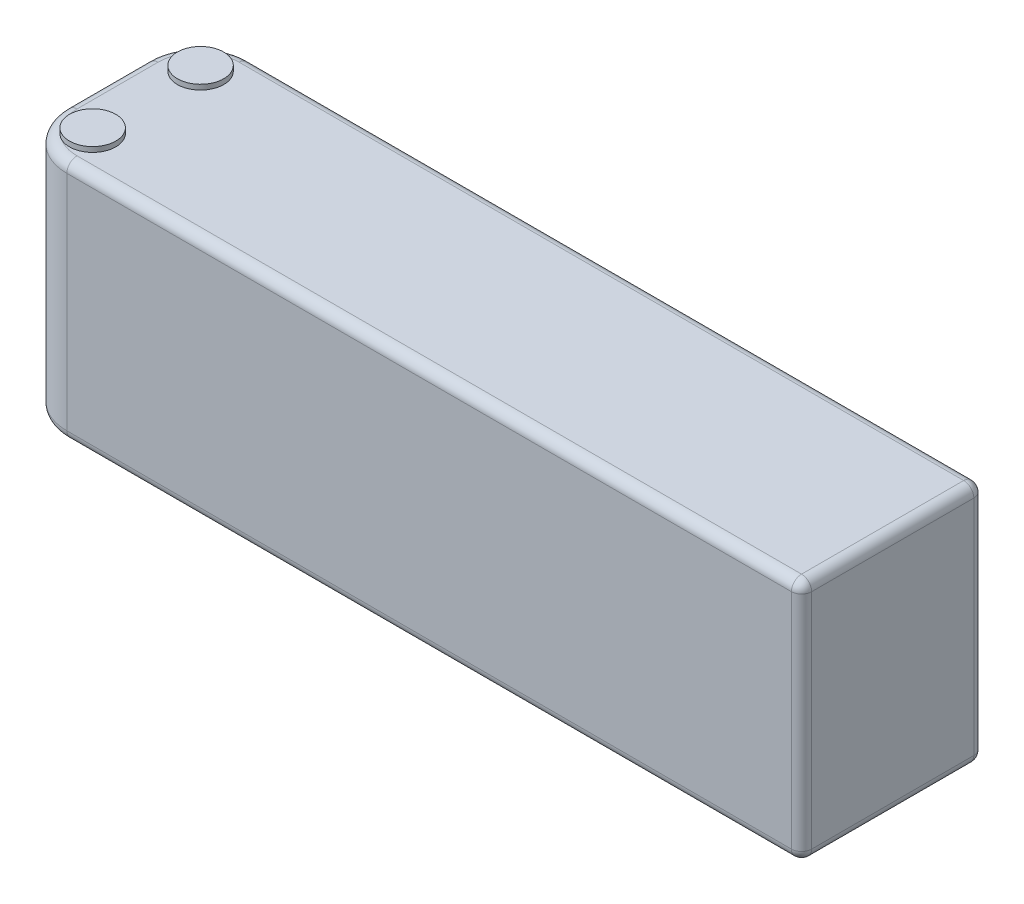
ISO-10303-21;
HEADER;
FILE_DESCRIPTION(('STEP AP214'),'2;1');
FILE_NAME('part.step','',(''),(''),'','','');
FILE_SCHEMA(('AUTOMOTIVE_DESIGN { 1 0 10303 214 1 1 1 1 }'));
ENDSEC;
DATA;
#1=APPLICATION_CONTEXT('core data for automotive mechanical design processes');
#2=APPLICATION_PROTOCOL_DEFINITION('international standard','automotive_design',2000,#1);
#3=PRODUCT_CONTEXT('',#1,'mechanical');
#4=PRODUCT('Part','Part','',(#3));
#5=PRODUCT_RELATED_PRODUCT_CATEGORY('part','',(#4));
#6=PRODUCT_DEFINITION_FORMATION('','',#4);
#7=PRODUCT_DEFINITION_CONTEXT('part definition',#1,'design');
#8=PRODUCT_DEFINITION('design','',#6,#7);
#9=PRODUCT_DEFINITION_SHAPE('','',#8);
#10=(LENGTH_UNIT() NAMED_UNIT(*) SI_UNIT(.MILLI.,.METRE.));
#11=(NAMED_UNIT(*) PLANE_ANGLE_UNIT() SI_UNIT($,.RADIAN.));
#12=(NAMED_UNIT(*) SI_UNIT($,.STERADIAN.) SOLID_ANGLE_UNIT());
#13=UNCERTAINTY_MEASURE_WITH_UNIT(LENGTH_MEASURE(1.E-05),#10,'distance_accuracy_value','');
#14=(GEOMETRIC_REPRESENTATION_CONTEXT(3) GLOBAL_UNCERTAINTY_ASSIGNED_CONTEXT((#13)) GLOBAL_UNIT_ASSIGNED_CONTEXT((#10,
#11,#12)) REPRESENTATION_CONTEXT('',''));
#15=CARTESIAN_POINT('',(0.,0.,0.));
#16=DIRECTION('',(0.,0.,1.));
#17=DIRECTION('',(1.,0.,0.));
#18=AXIS2_PLACEMENT_3D('',#15,#16,#17);
#19=CARTESIAN_POINT('',(155.,48.,0.));
#20=DIRECTION('',(-1.,0.,0.));
#21=DIRECTION('',(0.,0.,1.));
#22=AXIS2_PLACEMENT_3D('',#19,#20,#21);
#23=PLANE('',#22);
#24=DIRECTION('',(0.,0.,-1.));
#25=VECTOR('',#24,1.);
#26=CARTESIAN_POINT('',(155.,2.,0.));
#27=LINE('',#26,#25);
#28=CARTESIAN_POINT('',(155.,2.,-2.));
#29=VERTEX_POINT('',#28);
#30=CARTESIAN_POINT('',(155.,2.,-34.));
#31=VERTEX_POINT('',#30);
#32=EDGE_CURVE('E49',#29,#31,#27,.T.);
#33=ORIENTED_EDGE('',*,*,#32,.T.);
#34=DIRECTION('',(0.,-1.,0.));
#35=VECTOR('',#34,1.);
#36=CARTESIAN_POINT('',(155.,48.,-34.));
#37=LINE('',#36,#35);
#38=CARTESIAN_POINT('',(155.,46.,-34.));
#39=VERTEX_POINT('',#38);
#40=EDGE_CURVE('E11',#31,#39,#37,.F.);
#41=ORIENTED_EDGE('',*,*,#40,.T.);
#42=DIRECTION('',(0.,0.,-1.));
#43=VECTOR('',#42,1.);
#44=CARTESIAN_POINT('',(155.,46.,0.));
#45=LINE('',#44,#43);
#46=CARTESIAN_POINT('',(155.,46.,-2.));
#47=VERTEX_POINT('',#46);
#48=EDGE_CURVE('E288',#39,#47,#45,.F.);
#49=ORIENTED_EDGE('',*,*,#48,.T.);
#50=DIRECTION('',(0.,-1.,0.));
#51=VECTOR('',#50,1.);
#52=CARTESIAN_POINT('',(155.,48.,-2.));
#53=LINE('',#52,#51);
#54=EDGE_CURVE('E285',#47,#29,#53,.T.);
#55=ORIENTED_EDGE('',*,*,#54,.T.);
#56=EDGE_LOOP('',(#33,#41,#49,#55));
#57=FACE_BOUND('',#56,.T.);
#58=ADVANCED_FACE('F39',(#57),#23,.F.);
#59=CARTESIAN_POINT('',(155.,48.,-36.));
#60=DIRECTION('',(0.,0.,1.));
#61=DIRECTION('',(1.,0.,0.));
#62=AXIS2_PLACEMENT_3D('',#59,#60,#61);
#63=PLANE('',#62);
#64=DIRECTION('',(0.,-1.,0.));
#65=VECTOR('',#64,1.);
#66=CARTESIAN_POINT('',(10.0000000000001,48.,-36.));
#67=LINE('',#66,#65);
#68=CARTESIAN_POINT('',(10.0000000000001,46.,-36.));
#69=VERTEX_POINT('',#68);
#70=CARTESIAN_POINT('',(10.0000000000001,2.,-36.));
#71=VERTEX_POINT('',#70);
#72=EDGE_CURVE('E210',#69,#71,#67,.T.);
#73=ORIENTED_EDGE('',*,*,#72,.F.);
#74=DIRECTION('',(-1.,0.,0.));
#75=VECTOR('',#74,1.);
#76=CARTESIAN_POINT('',(155.,46.,-36.));
#77=LINE('',#76,#75);
#78=CARTESIAN_POINT('',(153.,46.,-36.));
#79=VERTEX_POINT('',#78);
#80=EDGE_CURVE('E274',#69,#79,#77,.F.);
#81=ORIENTED_EDGE('',*,*,#80,.T.);
#82=DIRECTION('',(0.,-1.,0.));
#83=VECTOR('',#82,1.);
#84=CARTESIAN_POINT('',(153.,48.,-36.));
#85=LINE('',#84,#83);
#86=CARTESIAN_POINT('',(153.,2.,-36.));
#87=VERTEX_POINT('',#86);
#88=EDGE_CURVE('E271',#79,#87,#85,.T.);
#89=ORIENTED_EDGE('',*,*,#88,.T.);
#90=DIRECTION('',(-1.,0.,0.));
#91=VECTOR('',#90,1.);
#92=CARTESIAN_POINT('',(155.,2.,-36.));
#93=LINE('',#92,#91);
#94=EDGE_CURVE('E268',#87,#71,#93,.T.);
#95=ORIENTED_EDGE('',*,*,#94,.T.);
#96=EDGE_LOOP('',(#73,#81,#89,#95));
#97=FACE_BOUND('',#96,.T.);
#98=ADVANCED_FACE('F431',(#97),#63,.F.);
#99=CARTESIAN_POINT('',(10.,48.,-26.));
#100=DIRECTION('',(0.,-1.,0.));
#101=DIRECTION('',(0.,0.,-1.));
#102=AXIS2_PLACEMENT_3D('',#99,#100,#101);
#103=CYLINDRICAL_SURFACE('',#102,10.);
#104=DIRECTION('',(0.,-1.,0.));
#105=VECTOR('',#104,1.);
#106=CARTESIAN_POINT('',(0.,48.,-25.9999999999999));
#107=LINE('',#106,#105);
#108=CARTESIAN_POINT('',(0.,46.,-25.9999999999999));
#109=VERTEX_POINT('',#108);
#110=CARTESIAN_POINT('',(0.,2.,-25.9999999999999));
#111=VERTEX_POINT('',#110);
#112=EDGE_CURVE('E206',#109,#111,#107,.T.);
#113=ORIENTED_EDGE('',*,*,#112,.F.);
#114=CARTESIAN_POINT('',(10.,46.,-26.));
#115=DIRECTION('',(0.,1.,0.));
#116=DIRECTION('',(0.,0.,1.));
#117=AXIS2_PLACEMENT_3D('',#114,#115,#116);
#118=CIRCLE('',#117,10.);
#119=EDGE_CURVE('E233',#109,#69,#118,.F.);
#120=ORIENTED_EDGE('',*,*,#119,.T.);
#121=ORIENTED_EDGE('',*,*,#72,.T.);
#122=CARTESIAN_POINT('',(10.,2.,-26.));
#123=DIRECTION('',(0.,1.,0.));
#124=DIRECTION('',(0.,0.,1.));
#125=AXIS2_PLACEMENT_3D('',#122,#123,#124);
#126=CIRCLE('',#125,10.);
#127=EDGE_CURVE('E230',#71,#111,#126,.T.);
#128=ORIENTED_EDGE('',*,*,#127,.T.);
#129=EDGE_LOOP('',(#113,#120,#121,#128));
#130=FACE_BOUND('',#129,.T.);
#131=ADVANCED_FACE('F419',(#130),#103,.T.);
#132=CARTESIAN_POINT('',(0.,48.,-25.9999999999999));
#133=DIRECTION('',(1.,0.,0.));
#134=DIRECTION('',(0.,0.,-1.));
#135=AXIS2_PLACEMENT_3D('',#132,#133,#134);
#136=PLANE('',#135);
#137=DIRECTION('',(0.,-1.,0.));
#138=VECTOR('',#137,1.);
#139=CARTESIAN_POINT('',(0.,48.,-10.0000000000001));
#140=LINE('',#139,#138);
#141=CARTESIAN_POINT('',(0.,46.,-10.0000000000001));
#142=VERTEX_POINT('',#141);
#143=CARTESIAN_POINT('',(0.,2.,-10.0000000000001));
#144=VERTEX_POINT('',#143);
#145=EDGE_CURVE('E202',#142,#144,#140,.T.);
#146=ORIENTED_EDGE('',*,*,#145,.F.);
#147=DIRECTION('',(0.,0.,1.));
#148=VECTOR('',#147,1.);
#149=CARTESIAN_POINT('',(0.,46.,-25.9999999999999));
#150=LINE('',#149,#148);
#151=EDGE_CURVE('E240',#142,#109,#150,.F.);
#152=ORIENTED_EDGE('',*,*,#151,.T.);
#153=ORIENTED_EDGE('',*,*,#112,.T.);
#154=DIRECTION('',(0.,0.,1.));
#155=VECTOR('',#154,1.);
#156=CARTESIAN_POINT('',(0.,2.,-25.9999999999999));
#157=LINE('',#156,#155);
#158=EDGE_CURVE('E237',#111,#144,#157,.T.);
#159=ORIENTED_EDGE('',*,*,#158,.T.);
#160=EDGE_LOOP('',(#146,#152,#153,#159));
#161=FACE_BOUND('',#160,.T.);
#162=ADVANCED_FACE('F416',(#161),#136,.F.);
#163=CARTESIAN_POINT('',(10.,48.,-10.));
#164=DIRECTION('',(0.,-1.,0.));
#165=DIRECTION('',(0.,0.,-1.));
#166=AXIS2_PLACEMENT_3D('',#163,#164,#165);
#167=CYLINDRICAL_SURFACE('',#166,10.);
#168=DIRECTION('',(0.,-1.,0.));
#169=VECTOR('',#168,1.);
#170=CARTESIAN_POINT('',(10.0000000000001,48.,0.));
#171=LINE('',#170,#169);
#172=CARTESIAN_POINT('',(10.0000000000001,46.,0.));
#173=VERTEX_POINT('',#172);
#174=CARTESIAN_POINT('',(10.0000000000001,2.,0.));
#175=VERTEX_POINT('',#174);
#176=EDGE_CURVE('E198',#173,#175,#171,.T.);
#177=ORIENTED_EDGE('',*,*,#176,.F.);
#178=CARTESIAN_POINT('',(10.,46.,-10.));
#179=DIRECTION('',(0.,1.,0.));
#180=DIRECTION('',(0.,0.,1.));
#181=AXIS2_PLACEMENT_3D('',#178,#179,#180);
#182=CIRCLE('',#181,10.);
#183=EDGE_CURVE('E246',#173,#142,#182,.F.);
#184=ORIENTED_EDGE('',*,*,#183,.T.);
#185=ORIENTED_EDGE('',*,*,#145,.T.);
#186=CARTESIAN_POINT('',(10.,2.,-10.));
#187=DIRECTION('',(0.,1.,0.));
#188=DIRECTION('',(0.,0.,1.));
#189=AXIS2_PLACEMENT_3D('',#186,#187,#188);
#190=CIRCLE('',#189,10.);
#191=EDGE_CURVE('E243',#144,#175,#190,.T.);
#192=ORIENTED_EDGE('',*,*,#191,.T.);
#193=EDGE_LOOP('',(#177,#184,#185,#192));
#194=FACE_BOUND('',#193,.T.);
#195=ADVANCED_FACE('F404',(#194),#167,.T.);
#196=CARTESIAN_POINT('',(10.0000000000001,48.,0.));
#197=DIRECTION('',(0.,0.,-1.));
#198=DIRECTION('',(-1.,0.,0.));
#199=AXIS2_PLACEMENT_3D('',#196,#197,#198);
#200=PLANE('',#199);
#201=ORIENTED_EDGE('',*,*,#176,.T.);
#202=DIRECTION('',(1.,0.,0.));
#203=VECTOR('',#202,1.);
#204=CARTESIAN_POINT('',(10.0000000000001,2.,0.));
#205=LINE('',#204,#203);
#206=CARTESIAN_POINT('',(153.,2.,0.));
#207=VERTEX_POINT('',#206);
#208=EDGE_CURVE('E282',#175,#207,#205,.T.);
#209=ORIENTED_EDGE('',*,*,#208,.T.);
#210=DIRECTION('',(0.,-1.,0.));
#211=VECTOR('',#210,1.);
#212=CARTESIAN_POINT('',(153.,48.,0.));
#213=LINE('',#212,#211);
#214=CARTESIAN_POINT('',(153.,46.,0.));
#215=VERTEX_POINT('',#214);
#216=EDGE_CURVE('E277',#207,#215,#213,.F.);
#217=ORIENTED_EDGE('',*,*,#216,.T.);
#218=DIRECTION('',(1.,0.,0.));
#219=VECTOR('',#218,1.);
#220=CARTESIAN_POINT('',(10.0000000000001,46.,0.));
#221=LINE('',#220,#219);
#222=EDGE_CURVE('E280',#215,#173,#221,.F.);
#223=ORIENTED_EDGE('',*,*,#222,.T.);
#224=EDGE_LOOP('',(#201,#209,#217,#223));
#225=FACE_BOUND('',#224,.T.);
#226=ADVANCED_FACE('F400',(#225),#200,.F.);
#227=CARTESIAN_POINT('',(10.,48.,-26.));
#228=DIRECTION('',(0.,1.,0.));
#229=DIRECTION('',(0.,0.,1.));
#230=AXIS2_PLACEMENT_3D('',#227,#228,#229);
#231=PLANE('',#230);
#232=CARTESIAN_POINT('',(10.,48.,-10.));
#233=DIRECTION('',(0.,1.,0.));
#234=DIRECTION('',(0.,0.,1.));
#235=AXIS2_PLACEMENT_3D('',#232,#233,#234);
#236=CIRCLE('',#235,8.);
#237=CARTESIAN_POINT('',(2.,48.,-10.0000000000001));
#238=VERTEX_POINT('',#237);
#239=CARTESIAN_POINT('',(4.02544666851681,48.,-4.67978266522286));
#240=VERTEX_POINT('',#239);
#241=EDGE_CURVE('E166',#238,#240,#236,.T.);
#242=ORIENTED_EDGE('',*,*,#241,.T.);
#243=CARTESIAN_POINT('',(7.73813967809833,48.,-7.34911066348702));
#244=DIRECTION('',(0.,1.,0.));
#245=DIRECTION('',(0.,0.,-1.));
#246=AXIS2_PLACEMENT_3D('',#243,#244,#245);
#247=CIRCLE('',#246,4.57267988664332);
#248=CARTESIAN_POINT('',(5.68641463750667,48.,-3.26256864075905));
#249=VERTEX_POINT('',#248);
#250=EDGE_CURVE('E168',#249,#240,#247,.T.);
#251=ORIENTED_EDGE('',*,*,#250,.F.);
#252=CARTESIAN_POINT('',(10.0000000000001,48.,-2.));
#253=VERTEX_POINT('',#252);
#254=EDGE_CURVE('E155',#249,#253,#236,.T.);
#255=ORIENTED_EDGE('',*,*,#254,.T.);
#256=DIRECTION('',(1.,0.,0.));
#257=VECTOR('',#256,1.);
#258=CARTESIAN_POINT('',(155.,48.,-2.));
#259=LINE('',#258,#257);
#260=CARTESIAN_POINT('',(153.,48.,-2.));
#261=VERTEX_POINT('',#260);
#262=EDGE_CURVE('E217',#253,#261,#259,.T.);
#263=ORIENTED_EDGE('',*,*,#262,.T.);
#264=DIRECTION('',(0.,0.,-1.));
#265=VECTOR('',#264,1.);
#266=CARTESIAN_POINT('',(153.,48.,-36.));
#267=LINE('',#266,#265);
#268=CARTESIAN_POINT('',(153.,48.,-34.));
#269=VERTEX_POINT('',#268);
#270=EDGE_CURVE('E214',#261,#269,#267,.T.);
#271=ORIENTED_EDGE('',*,*,#270,.T.);
#272=DIRECTION('',(-1.,0.,0.));
#273=VECTOR('',#272,1.);
#274=CARTESIAN_POINT('',(10.0000000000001,48.,-34.));
#275=LINE('',#274,#273);
#276=CARTESIAN_POINT('',(10.0000000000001,48.,-34.));
#277=VERTEX_POINT('',#276);
#278=EDGE_CURVE('E164',#269,#277,#275,.T.);
#279=ORIENTED_EDGE('',*,*,#278,.T.);
#280=CARTESIAN_POINT('',(10.,48.,-26.));
#281=DIRECTION('',(0.,1.,0.));
#282=DIRECTION('',(0.,0.,1.));
#283=AXIS2_PLACEMENT_3D('',#280,#281,#282);
#284=CIRCLE('',#283,8.);
#285=CARTESIAN_POINT('',(5.68641463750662,48.,-32.7374313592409));
#286=VERTEX_POINT('',#285);
#287=EDGE_CURVE('E227',#277,#286,#284,.T.);
#288=ORIENTED_EDGE('',*,*,#287,.T.);
#289=CARTESIAN_POINT('',(7.73813967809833,48.,-28.650889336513));
#290=DIRECTION('',(0.,1.,0.));
#291=DIRECTION('',(0.,0.,1.));
#292=AXIS2_PLACEMENT_3D('',#289,#290,#291);
#293=CIRCLE('',#292,4.57267988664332);
#294=CARTESIAN_POINT('',(4.02544666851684,48.,-31.3202173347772));
#295=VERTEX_POINT('',#294);
#296=EDGE_CURVE('E186',#295,#286,#293,.T.);
#297=ORIENTED_EDGE('',*,*,#296,.F.);
#298=CARTESIAN_POINT('',(2.,48.,-25.9999999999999));
#299=VERTEX_POINT('',#298);
#300=EDGE_CURVE('E226',#295,#299,#284,.T.);
#301=ORIENTED_EDGE('',*,*,#300,.T.);
#302=DIRECTION('',(0.,0.,1.));
#303=VECTOR('',#302,1.);
#304=CARTESIAN_POINT('',(2.,48.,-10.0000000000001));
#305=LINE('',#304,#303);
#306=EDGE_CURVE('E223',#299,#238,#305,.T.);
#307=ORIENTED_EDGE('',*,*,#306,.T.);
#308=EDGE_LOOP('',(#242,#251,#255,#263,#271,#279,#288,#297,#301,#307));
#309=FACE_BOUND('',#308,.T.);
#310=ADVANCED_FACE('F169',(#309),#231,.T.);
#311=CARTESIAN_POINT('',(10.,0.,-26.));
#312=DIRECTION('',(0.,1.,0.));
#313=DIRECTION('',(0.,0.,1.));
#314=AXIS2_PLACEMENT_3D('',#311,#312,#313);
#315=PLANE('',#314);
#316=DIRECTION('',(1.,0.,0.));
#317=VECTOR('',#316,1.);
#318=CARTESIAN_POINT('',(10.,0.,-2.));
#319=LINE('',#318,#317);
#320=CARTESIAN_POINT('',(153.,0.,-2.));
#321=VERTEX_POINT('',#320);
#322=CARTESIAN_POINT('',(10.0000000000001,0.,-2.));
#323=VERTEX_POINT('',#322);
#324=EDGE_CURVE('E255',#321,#323,#319,.F.);
#325=ORIENTED_EDGE('',*,*,#324,.T.);
#326=CARTESIAN_POINT('',(10.,0.,-10.));
#327=DIRECTION('',(0.,1.,0.));
#328=DIRECTION('',(0.,0.,1.));
#329=AXIS2_PLACEMENT_3D('',#326,#327,#328);
#330=CIRCLE('',#329,8.);
#331=CARTESIAN_POINT('',(2.,0.,-10.0000000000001));
#332=VERTEX_POINT('',#331);
#333=EDGE_CURVE('E264',#323,#332,#330,.F.);
#334=ORIENTED_EDGE('',*,*,#333,.T.);
#335=DIRECTION('',(0.,0.,1.));
#336=VECTOR('',#335,1.);
#337=CARTESIAN_POINT('',(2.,0.,-26.));
#338=LINE('',#337,#336);
#339=CARTESIAN_POINT('',(2.,0.,-25.9999999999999));
#340=VERTEX_POINT('',#339);
#341=EDGE_CURVE('E261',#332,#340,#338,.F.);
#342=ORIENTED_EDGE('',*,*,#341,.T.);
#343=CARTESIAN_POINT('',(10.,0.,-26.));
#344=DIRECTION('',(0.,1.,0.));
#345=DIRECTION('',(0.,0.,1.));
#346=AXIS2_PLACEMENT_3D('',#343,#344,#345);
#347=CIRCLE('',#346,8.);
#348=CARTESIAN_POINT('',(10.0000000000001,0.,-34.));
#349=VERTEX_POINT('',#348);
#350=EDGE_CURVE('E258',#340,#349,#347,.F.);
#351=ORIENTED_EDGE('',*,*,#350,.T.);
#352=DIRECTION('',(-1.,0.,0.));
#353=VECTOR('',#352,1.);
#354=CARTESIAN_POINT('',(10.,0.,-34.));
#355=LINE('',#354,#353);
#356=CARTESIAN_POINT('',(153.,0.,-34.));
#357=VERTEX_POINT('',#356);
#358=EDGE_CURVE('E249',#349,#357,#355,.F.);
#359=ORIENTED_EDGE('',*,*,#358,.T.);
#360=DIRECTION('',(0.,0.,-1.));
#361=VECTOR('',#360,1.);
#362=CARTESIAN_POINT('',(153.,0.,-26.));
#363=LINE('',#362,#361);
#364=EDGE_CURVE('E252',#357,#321,#363,.F.);
#365=ORIENTED_EDGE('',*,*,#364,.T.);
#366=EDGE_LOOP('',(#325,#334,#342,#351,#359,#365));
#367=FACE_BOUND('',#366,.T.);
#368=ADVANCED_FACE('F376',(#367),#315,.F.);
#369=CARTESIAN_POINT('',(10.,2.,-10.));
#370=DIRECTION('',(0.,1.,0.));
#371=DIRECTION('',(0.,0.,1.));
#372=AXIS2_PLACEMENT_3D('',#369,#370,#371);
#373=TOROIDAL_SURFACE('',#372,8.,2.);
#374=CARTESIAN_POINT('',(10.0000000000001,2.,-2.));
#375=DIRECTION('',(1.,0.,0.));
#376=DIRECTION('',(0.,0.,-1.));
#377=AXIS2_PLACEMENT_3D('',#374,#375,#376);
#378=CIRCLE('',#377,2.);
#379=EDGE_CURVE('E358',#175,#323,#378,.T.);
#380=ORIENTED_EDGE('',*,*,#379,.F.);
#381=ORIENTED_EDGE('',*,*,#191,.F.);
#382=CARTESIAN_POINT('',(2.,2.,-10.0000000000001));
#383=DIRECTION('',(0.,0.,-1.));
#384=DIRECTION('',(-1.,0.,0.));
#385=AXIS2_PLACEMENT_3D('',#382,#383,#384);
#386=CIRCLE('',#385,2.);
#387=EDGE_CURVE('E43',#332,#144,#386,.T.);
#388=ORIENTED_EDGE('',*,*,#387,.F.);
#389=ORIENTED_EDGE('',*,*,#333,.F.);
#390=EDGE_LOOP('',(#380,#381,#388,#389));
#391=FACE_BOUND('',#390,.T.);
#392=ADVANCED_FACE('F41',(#391),#373,.T.);
#393=CARTESIAN_POINT('',(2.,2.,-25.9999999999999));
#394=DIRECTION('',(0.,0.,1.));
#395=DIRECTION('',(1.,0.,0.));
#396=AXIS2_PLACEMENT_3D('',#393,#394,#395);
#397=CYLINDRICAL_SURFACE('',#396,2.);
#398=ORIENTED_EDGE('',*,*,#387,.T.);
#399=ORIENTED_EDGE('',*,*,#158,.F.);
#400=CARTESIAN_POINT('',(2.,2.,-25.9999999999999));
#401=DIRECTION('',(0.,0.,-1.));
#402=DIRECTION('',(-1.,0.,0.));
#403=AXIS2_PLACEMENT_3D('',#400,#401,#402);
#404=CIRCLE('',#403,2.);
#405=EDGE_CURVE('E355',#340,#111,#404,.T.);
#406=ORIENTED_EDGE('',*,*,#405,.F.);
#407=ORIENTED_EDGE('',*,*,#341,.F.);
#408=EDGE_LOOP('',(#398,#399,#406,#407));
#409=FACE_BOUND('',#408,.T.);
#410=ADVANCED_FACE('F370',(#409),#397,.T.);
#411=CARTESIAN_POINT('',(10.0000000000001,2.,-2.));
#412=DIRECTION('',(1.,0.,0.));
#413=DIRECTION('',(0.,0.,-1.));
#414=AXIS2_PLACEMENT_3D('',#411,#412,#413);
#415=CYLINDRICAL_SURFACE('',#414,2.);
#416=ORIENTED_EDGE('',*,*,#379,.T.);
#417=ORIENTED_EDGE('',*,*,#324,.F.);
#418=CARTESIAN_POINT('',(153.,2.,-2.));
#419=DIRECTION('',(1.,0.,0.));
#420=DIRECTION('',(0.,0.,-1.));
#421=AXIS2_PLACEMENT_3D('',#418,#419,#420);
#422=CIRCLE('',#421,2.);
#423=EDGE_CURVE('E351',#207,#321,#422,.T.);
#424=ORIENTED_EDGE('',*,*,#423,.F.);
#425=ORIENTED_EDGE('',*,*,#208,.F.);
#426=EDGE_LOOP('',(#416,#417,#424,#425));
#427=FACE_BOUND('',#426,.T.);
#428=ADVANCED_FACE('F379',(#427),#415,.T.);
#429=CARTESIAN_POINT('',(10.,2.,-26.));
#430=DIRECTION('',(0.,1.,0.));
#431=DIRECTION('',(0.,0.,1.));
#432=AXIS2_PLACEMENT_3D('',#429,#430,#431);
#433=TOROIDAL_SURFACE('',#432,8.,2.);
#434=ORIENTED_EDGE('',*,*,#405,.T.);
#435=ORIENTED_EDGE('',*,*,#127,.F.);
#436=CARTESIAN_POINT('',(10.0000000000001,2.,-34.));
#437=DIRECTION('',(1.,0.,0.));
#438=DIRECTION('',(0.,0.,-1.));
#439=AXIS2_PLACEMENT_3D('',#436,#437,#438);
#440=CIRCLE('',#439,2.);
#441=EDGE_CURVE('E347',#349,#71,#440,.T.);
#442=ORIENTED_EDGE('',*,*,#441,.F.);
#443=ORIENTED_EDGE('',*,*,#350,.F.);
#444=EDGE_LOOP('',(#434,#435,#442,#443));
#445=FACE_BOUND('',#444,.T.);
#446=ADVANCED_FACE('F681',(#445),#433,.T.);
#447=CARTESIAN_POINT('',(153.,2.,-2.));
#448=DIRECTION('',(0.,-1.,0.));
#449=DIRECTION('',(0.,0.,-1.));
#450=AXIS2_PLACEMENT_3D('',#447,#448,#449);
#451=SPHERICAL_SURFACE('',#450,2.);
#452=CARTESIAN_POINT('',(153.,2.,-2.));
#453=DIRECTION('',(0.,-1.,0.));
#454=DIRECTION('',(0.,0.,-1.));
#455=AXIS2_PLACEMENT_3D('',#452,#453,#454);
#456=CIRCLE('',#455,2.);
#457=EDGE_CURVE('E339',#207,#29,#456,.F.);
#458=ORIENTED_EDGE('',*,*,#457,.F.);
#459=ORIENTED_EDGE('',*,*,#423,.T.);
#460=CARTESIAN_POINT('',(153.,2.,-2.));
#461=DIRECTION('',(0.,0.,1.));
#462=DIRECTION('',(1.,0.,0.));
#463=AXIS2_PLACEMENT_3D('',#460,#461,#462);
#464=CIRCLE('',#463,2.);
#465=EDGE_CURVE('E343',#29,#321,#464,.F.);
#466=ORIENTED_EDGE('',*,*,#465,.F.);
#467=EDGE_LOOP('',(#458,#459,#466));
#468=FACE_BOUND('',#467,.T.);
#469=ADVANCED_FACE('F383',(#468),#451,.T.);
#470=CARTESIAN_POINT('',(155.,2.,-34.));
#471=DIRECTION('',(-1.,0.,0.));
#472=DIRECTION('',(0.,0.,1.));
#473=AXIS2_PLACEMENT_3D('',#470,#471,#472);
#474=CYLINDRICAL_SURFACE('',#473,2.);
#475=ORIENTED_EDGE('',*,*,#441,.T.);
#476=ORIENTED_EDGE('',*,*,#94,.F.);
#477=CARTESIAN_POINT('',(153.,2.,-34.));
#478=DIRECTION('',(1.,0.,0.));
#479=DIRECTION('',(0.,0.,-1.));
#480=AXIS2_PLACEMENT_3D('',#477,#478,#479);
#481=CIRCLE('',#480,2.);
#482=EDGE_CURVE('E335',#357,#87,#481,.T.);
#483=ORIENTED_EDGE('',*,*,#482,.F.);
#484=ORIENTED_EDGE('',*,*,#358,.F.);
#485=EDGE_LOOP('',(#475,#476,#483,#484));
#486=FACE_BOUND('',#485,.T.);
#487=ADVANCED_FACE('F660',(#486),#474,.T.);
#488=CARTESIAN_POINT('',(153.,2.,0.));
#489=DIRECTION('',(0.,0.,-1.));
#490=DIRECTION('',(-1.,0.,0.));
#491=AXIS2_PLACEMENT_3D('',#488,#489,#490);
#492=CYLINDRICAL_SURFACE('',#491,2.);
#493=ORIENTED_EDGE('',*,*,#465,.T.);
#494=ORIENTED_EDGE('',*,*,#364,.F.);
#495=CARTESIAN_POINT('',(153.,2.,-34.));
#496=DIRECTION('',(0.,0.,-1.));
#497=DIRECTION('',(-1.,0.,0.));
#498=AXIS2_PLACEMENT_3D('',#495,#496,#497);
#499=CIRCLE('',#498,2.);
#500=EDGE_CURVE('E331',#31,#357,#499,.T.);
#501=ORIENTED_EDGE('',*,*,#500,.F.);
#502=ORIENTED_EDGE('',*,*,#32,.F.);
#503=EDGE_LOOP('',(#493,#494,#501,#502));
#504=FACE_BOUND('',#503,.T.);
#505=ADVANCED_FACE('F387',(#504),#492,.T.);
#506=CARTESIAN_POINT('',(153.,48.,-2.));
#507=DIRECTION('',(0.,-1.,0.));
#508=DIRECTION('',(0.,0.,-1.));
#509=AXIS2_PLACEMENT_3D('',#506,#507,#508);
#510=CYLINDRICAL_SURFACE('',#509,2.);
#511=ORIENTED_EDGE('',*,*,#457,.T.);
#512=ORIENTED_EDGE('',*,*,#54,.F.);
#513=CARTESIAN_POINT('',(153.,46.,-2.));
#514=DIRECTION('',(0.,1.,0.));
#515=DIRECTION('',(0.,0.,1.));
#516=AXIS2_PLACEMENT_3D('',#513,#514,#515);
#517=CIRCLE('',#516,2.);
#518=EDGE_CURVE('E327',#215,#47,#517,.T.);
#519=ORIENTED_EDGE('',*,*,#518,.F.);
#520=ORIENTED_EDGE('',*,*,#216,.F.);
#521=EDGE_LOOP('',(#511,#512,#519,#520));
#522=FACE_BOUND('',#521,.T.);
#523=ADVANCED_FACE('F397',(#522),#510,.T.);
#524=CARTESIAN_POINT('',(153.,2.,-34.));
#525=DIRECTION('',(0.,-1.,0.));
#526=DIRECTION('',(0.,0.,-1.));
#527=AXIS2_PLACEMENT_3D('',#524,#525,#526);
#528=SPHERICAL_SURFACE('',#527,2.);
#529=ORIENTED_EDGE('',*,*,#500,.T.);
#530=ORIENTED_EDGE('',*,*,#482,.T.);
#531=CARTESIAN_POINT('',(153.,2.,-34.));
#532=DIRECTION('',(0.,-1.,0.));
#533=DIRECTION('',(0.,0.,-1.));
#534=AXIS2_PLACEMENT_3D('',#531,#532,#533);
#535=CIRCLE('',#534,2.);
#536=EDGE_CURVE('E323',#31,#87,#535,.F.);
#537=ORIENTED_EDGE('',*,*,#536,.F.);
#538=EDGE_LOOP('',(#529,#530,#537));
#539=FACE_BOUND('',#538,.T.);
#540=ADVANCED_FACE('F446',(#539),#528,.T.);
#541=CARTESIAN_POINT('',(153.,46.,-2.));
#542=DIRECTION('',(1.,0.,0.));
#543=DIRECTION('',(0.,0.,-1.));
#544=AXIS2_PLACEMENT_3D('',#541,#542,#543);
#545=SPHERICAL_SURFACE('',#544,2.);
#546=CARTESIAN_POINT('',(153.,46.,-2.));
#547=DIRECTION('',(1.,0.,0.));
#548=DIRECTION('',(0.,0.,-1.));
#549=AXIS2_PLACEMENT_3D('',#546,#547,#548);
#550=CIRCLE('',#549,2.);
#551=EDGE_CURVE('E315',#215,#261,#550,.F.);
#552=ORIENTED_EDGE('',*,*,#551,.F.);
#553=ORIENTED_EDGE('',*,*,#518,.T.);
#554=CARTESIAN_POINT('',(153.,46.,-2.));
#555=DIRECTION('',(0.,0.,1.));
#556=DIRECTION('',(0.,-1.,0.));
#557=AXIS2_PLACEMENT_3D('',#554,#555,#556);
#558=CIRCLE('',#557,2.);
#559=EDGE_CURVE('E319',#261,#47,#558,.F.);
#560=ORIENTED_EDGE('',*,*,#559,.F.);
#561=EDGE_LOOP('',(#552,#553,#560));
#562=FACE_BOUND('',#561,.T.);
#563=ADVANCED_FACE('F444',(#562),#545,.T.);
#564=CARTESIAN_POINT('',(153.,48.,-34.));
#565=DIRECTION('',(0.,-1.,0.));
#566=DIRECTION('',(0.,0.,-1.));
#567=AXIS2_PLACEMENT_3D('',#564,#565,#566);
#568=CYLINDRICAL_SURFACE('',#567,2.);
#569=ORIENTED_EDGE('',*,*,#536,.T.);
#570=ORIENTED_EDGE('',*,*,#88,.F.);
#571=CARTESIAN_POINT('',(153.,46.,-34.));
#572=DIRECTION('',(0.,1.,0.));
#573=DIRECTION('',(0.,0.,1.));
#574=AXIS2_PLACEMENT_3D('',#571,#572,#573);
#575=CIRCLE('',#574,2.);
#576=EDGE_CURVE('E311',#39,#79,#575,.T.);
#577=ORIENTED_EDGE('',*,*,#576,.F.);
#578=ORIENTED_EDGE('',*,*,#40,.F.);
#579=EDGE_LOOP('',(#569,#570,#577,#578));
#580=FACE_BOUND('',#579,.T.);
#581=ADVANCED_FACE('F435',(#580),#568,.T.);
#582=CARTESIAN_POINT('',(153.,46.,-26.));
#583=DIRECTION('',(0.,0.,1.));
#584=DIRECTION('',(1.,0.,0.));
#585=AXIS2_PLACEMENT_3D('',#582,#583,#584);
#586=CYLINDRICAL_SURFACE('',#585,2.);
#587=ORIENTED_EDGE('',*,*,#559,.T.);
#588=ORIENTED_EDGE('',*,*,#48,.F.);
#589=CARTESIAN_POINT('',(153.,46.,-34.));
#590=DIRECTION('',(0.,0.,-1.));
#591=DIRECTION('',(-1.,0.,0.));
#592=AXIS2_PLACEMENT_3D('',#589,#590,#591);
#593=CIRCLE('',#592,2.);
#594=EDGE_CURVE('E308',#269,#39,#593,.T.);
#595=ORIENTED_EDGE('',*,*,#594,.F.);
#596=ORIENTED_EDGE('',*,*,#270,.F.);
#597=EDGE_LOOP('',(#587,#588,#595,#596));
#598=FACE_BOUND('',#597,.T.);
#599=ADVANCED_FACE('F441',(#598),#586,.T.);
#600=CARTESIAN_POINT('',(10.,46.,-2.));
#601=DIRECTION('',(-1.,0.,0.));
#602=DIRECTION('',(0.,0.,1.));
#603=AXIS2_PLACEMENT_3D('',#600,#601,#602);
#604=CYLINDRICAL_SURFACE('',#603,2.);
#605=ORIENTED_EDGE('',*,*,#551,.T.);
#606=ORIENTED_EDGE('',*,*,#262,.F.);
#607=CARTESIAN_POINT('',(10.0000000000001,46.,-2.));
#608=DIRECTION('',(-1.,0.,0.));
#609=DIRECTION('',(0.,-1.,0.));
#610=AXIS2_PLACEMENT_3D('',#607,#608,#609);
#611=CIRCLE('',#610,2.);
#612=EDGE_CURVE('E160',#173,#253,#611,.T.);
#613=ORIENTED_EDGE('',*,*,#612,.F.);
#614=ORIENTED_EDGE('',*,*,#222,.F.);
#615=EDGE_LOOP('',(#605,#606,#613,#614));
#616=FACE_BOUND('',#615,.T.);
#617=ADVANCED_FACE('F407',(#616),#604,.T.);
#618=CARTESIAN_POINT('',(153.,46.,-34.));
#619=DIRECTION('',(1.,0.,0.));
#620=DIRECTION('',(0.,0.,-1.));
#621=AXIS2_PLACEMENT_3D('',#618,#619,#620);
#622=SPHERICAL_SURFACE('',#621,2.);
#623=ORIENTED_EDGE('',*,*,#594,.T.);
#624=ORIENTED_EDGE('',*,*,#576,.T.);
#625=CARTESIAN_POINT('',(153.,46.,-34.));
#626=DIRECTION('',(1.,0.,0.));
#627=DIRECTION('',(0.,0.,-1.));
#628=AXIS2_PLACEMENT_3D('',#625,#626,#627);
#629=CIRCLE('',#628,2.);
#630=EDGE_CURVE('E303',#269,#79,#629,.F.);
#631=ORIENTED_EDGE('',*,*,#630,.F.);
#632=EDGE_LOOP('',(#623,#624,#631));
#633=FACE_BOUND('',#632,.T.);
#634=ADVANCED_FACE('F437',(#633),#622,.T.);
#635=CARTESIAN_POINT('',(10.,46.,-10.));
#636=DIRECTION('',(0.,1.,0.));
#637=DIRECTION('',(0.,0.,1.));
#638=AXIS2_PLACEMENT_3D('',#635,#636,#637);
#639=TOROIDAL_SURFACE('',#638,8.,2.);
#640=ORIENTED_EDGE('',*,*,#612,.T.);
#641=ORIENTED_EDGE('',*,*,#254,.F.);
#642=EDGE_CURVE('E57',#240,#249,#236,.T.);
#643=ORIENTED_EDGE('',*,*,#642,.F.);
#644=ORIENTED_EDGE('',*,*,#241,.F.);
#645=CARTESIAN_POINT('',(2.,46.,-10.0000000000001));
#646=DIRECTION('',(0.,0.,-1.));
#647=DIRECTION('',(-1.,0.,0.));
#648=AXIS2_PLACEMENT_3D('',#645,#646,#647);
#649=CIRCLE('',#648,2.);
#650=EDGE_CURVE('E299',#142,#238,#649,.T.);
#651=ORIENTED_EDGE('',*,*,#650,.F.);
#652=ORIENTED_EDGE('',*,*,#183,.F.);
#653=EDGE_LOOP('',(#640,#641,#643,#644,#651,#652));
#654=FACE_BOUND('',#653,.T.);
#655=ADVANCED_FACE('F157',(#654),#639,.T.);
#656=CARTESIAN_POINT('',(10.,46.,-34.));
#657=DIRECTION('',(1.,0.,0.));
#658=DIRECTION('',(0.,0.,-1.));
#659=AXIS2_PLACEMENT_3D('',#656,#657,#658);
#660=CYLINDRICAL_SURFACE('',#659,2.);
#661=ORIENTED_EDGE('',*,*,#630,.T.);
#662=ORIENTED_EDGE('',*,*,#80,.F.);
#663=CARTESIAN_POINT('',(10.0000000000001,46.,-34.));
#664=DIRECTION('',(-1.,0.,0.));
#665=DIRECTION('',(0.,0.,1.));
#666=AXIS2_PLACEMENT_3D('',#663,#664,#665);
#667=CIRCLE('',#666,2.);
#668=EDGE_CURVE('E296',#277,#69,#667,.T.);
#669=ORIENTED_EDGE('',*,*,#668,.F.);
#670=ORIENTED_EDGE('',*,*,#278,.F.);
#671=EDGE_LOOP('',(#661,#662,#669,#670));
#672=FACE_BOUND('',#671,.T.);
#673=ADVANCED_FACE('F427',(#672),#660,.T.);
#674=CARTESIAN_POINT('',(2.,46.,-26.));
#675=DIRECTION('',(0.,0.,-1.));
#676=DIRECTION('',(-1.,0.,0.));
#677=AXIS2_PLACEMENT_3D('',#674,#675,#676);
#678=CYLINDRICAL_SURFACE('',#677,2.);
#679=ORIENTED_EDGE('',*,*,#650,.T.);
#680=ORIENTED_EDGE('',*,*,#306,.F.);
#681=CARTESIAN_POINT('',(2.,46.,-25.9999999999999));
#682=DIRECTION('',(0.,0.,-1.));
#683=DIRECTION('',(0.,1.,0.));
#684=AXIS2_PLACEMENT_3D('',#681,#682,#683);
#685=CIRCLE('',#684,2.);
#686=EDGE_CURVE('E193',#109,#299,#685,.T.);
#687=ORIENTED_EDGE('',*,*,#686,.F.);
#688=ORIENTED_EDGE('',*,*,#151,.F.);
#689=EDGE_LOOP('',(#679,#680,#687,#688));
#690=FACE_BOUND('',#689,.T.);
#691=ADVANCED_FACE('F413',(#690),#678,.T.);
#692=CARTESIAN_POINT('',(10.,46.,-26.));
#693=DIRECTION('',(0.,1.,0.));
#694=DIRECTION('',(0.,0.,1.));
#695=AXIS2_PLACEMENT_3D('',#692,#693,#694);
#696=TOROIDAL_SURFACE('',#695,8.,2.);
#697=ORIENTED_EDGE('',*,*,#668,.T.);
#698=ORIENTED_EDGE('',*,*,#119,.F.);
#699=ORIENTED_EDGE('',*,*,#686,.T.);
#700=ORIENTED_EDGE('',*,*,#300,.F.);
#701=EDGE_CURVE('E65',#286,#295,#284,.T.);
#702=ORIENTED_EDGE('',*,*,#701,.F.);
#703=ORIENTED_EDGE('',*,*,#287,.F.);
#704=EDGE_LOOP('',(#697,#698,#699,#700,#702,#703));
#705=FACE_BOUND('',#704,.T.);
#706=ADVANCED_FACE('F422',(#705),#696,.T.);
#707=CARTESIAN_POINT('',(7.73813967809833,49.,-28.650889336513));
#708=DIRECTION('',(0.,-1.,0.));
#709=DIRECTION('',(0.,0.,-1.));
#710=AXIS2_PLACEMENT_3D('',#707,#708,#709);
#711=CYLINDRICAL_SURFACE('',#710,4.57267988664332);
#712=CARTESIAN_POINT('',(7.73813967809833,49.,-28.650889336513));
#713=DIRECTION('',(0.,1.,0.));
#714=DIRECTION('',(0.,0.,1.));
#715=AXIS2_PLACEMENT_3D('',#712,#713,#714);
#716=CIRCLE('',#715,4.57267988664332);
#717=CARTESIAN_POINT('',(7.73813967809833,49.,-24.0782094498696));
#718=VERTEX_POINT('',#717);
#719=EDGE_CURVE('E189',#718,#718,#716,.T.);
#720=ORIENTED_EDGE('',*,*,#719,.F.);
#721=EDGE_LOOP('',(#720));
#722=FACE_BOUND('',#721,.T.);
#723=EDGE_CURVE('E194',#286,#295,#293,.T.);
#724=ORIENTED_EDGE('',*,*,#723,.T.);
#725=ORIENTED_EDGE('',*,*,#296,.T.);
#726=EDGE_LOOP('',(#724,#725));
#727=FACE_BOUND('',#726,.T.);
#728=ADVANCED_FACE('F465',(#722,#727),#711,.T.);
#729=CARTESIAN_POINT('',(7.73813967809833,49.,-28.650889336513));
#730=DIRECTION('',(0.,1.,0.));
#731=DIRECTION('',(0.,0.,1.));
#732=AXIS2_PLACEMENT_3D('',#729,#730,#731);
#733=PLANE('',#732);
#734=ORIENTED_EDGE('',*,*,#719,.T.);
#735=EDGE_LOOP('',(#734));
#736=FACE_BOUND('',#735,.T.);
#737=ADVANCED_FACE('F504',(#736),#733,.T.);
#738=CARTESIAN_POINT('',(7.73813967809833,48.,-28.650889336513));
#739=DIRECTION('',(0.,1.,0.));
#740=DIRECTION('',(0.,0.,1.));
#741=AXIS2_PLACEMENT_3D('',#738,#739,#740);
#742=PLANE('',#741);
#743=ORIENTED_EDGE('',*,*,#701,.T.);
#744=ORIENTED_EDGE('',*,*,#723,.F.);
#745=EDGE_LOOP('',(#743,#744));
#746=FACE_BOUND('',#745,.T.);
#747=ADVANCED_FACE('F511',(#746),#742,.F.);
#748=CARTESIAN_POINT('',(7.73813967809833,49.,-7.34911066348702));
#749=DIRECTION('',(0.,-1.,0.));
#750=DIRECTION('',(0.,0.,-1.));
#751=AXIS2_PLACEMENT_3D('',#748,#749,#750);
#752=CYLINDRICAL_SURFACE('',#751,4.57267988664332);
#753=CARTESIAN_POINT('',(7.73813967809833,49.,-7.34911066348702));
#754=DIRECTION('',(0.,1.,0.));
#755=DIRECTION('',(0.,0.,-1.));
#756=AXIS2_PLACEMENT_3D('',#753,#754,#755);
#757=CIRCLE('',#756,4.57267988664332);
#758=CARTESIAN_POINT('',(7.73813967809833,49.,-11.9217905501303));
#759=VERTEX_POINT('',#758);
#760=EDGE_CURVE('E181',#759,#759,#757,.T.);
#761=ORIENTED_EDGE('',*,*,#760,.F.);
#762=EDGE_LOOP('',(#761));
#763=FACE_BOUND('',#762,.T.);
#764=EDGE_CURVE('E174',#240,#249,#247,.T.);
#765=ORIENTED_EDGE('',*,*,#764,.T.);
#766=ORIENTED_EDGE('',*,*,#250,.T.);
#767=EDGE_LOOP('',(#765,#766));
#768=FACE_BOUND('',#767,.T.);
#769=ADVANCED_FACE('F179',(#763,#768),#752,.T.);
#770=CARTESIAN_POINT('',(7.73813967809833,49.,-7.34911066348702));
#771=DIRECTION('',(0.,-1.,0.));
#772=DIRECTION('',(0.,0.,-1.));
#773=AXIS2_PLACEMENT_3D('',#770,#771,#772);
#774=PLANE('',#773);
#775=ORIENTED_EDGE('',*,*,#760,.T.);
#776=EDGE_LOOP('',(#775));
#777=FACE_BOUND('',#776,.T.);
#778=ADVANCED_FACE('F524',(#777),#774,.F.);
#779=CARTESIAN_POINT('',(7.73813967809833,48.,-7.34911066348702));
#780=DIRECTION('',(0.,-1.,0.));
#781=DIRECTION('',(0.,0.,-1.));
#782=AXIS2_PLACEMENT_3D('',#779,#780,#781);
#783=PLANE('',#782);
#784=ORIENTED_EDGE('',*,*,#642,.T.);
#785=ORIENTED_EDGE('',*,*,#764,.F.);
#786=EDGE_LOOP('',(#784,#785));
#787=FACE_BOUND('',#786,.T.);
#788=ADVANCED_FACE('F177',(#787),#783,.T.);
#789=CLOSED_SHELL('',(#58,#98,#131,#162,#195,#226,#310,#368,#392,#410,#428,#446,#469,#487,#505,
#523,#540,#563,#581,#599,#617,#634,#655,#673,#691,#706,#728,#737,#747,#769,#778,#788));
#790=MANIFOLD_SOLID_BREP('B2',#789);
#791=ADVANCED_BREP_SHAPE_REPRESENTATION('',(#18,#790),#14);
#792=SHAPE_DEFINITION_REPRESENTATION(#9,#791);
ENDSEC;
END-ISO-10303-21;
